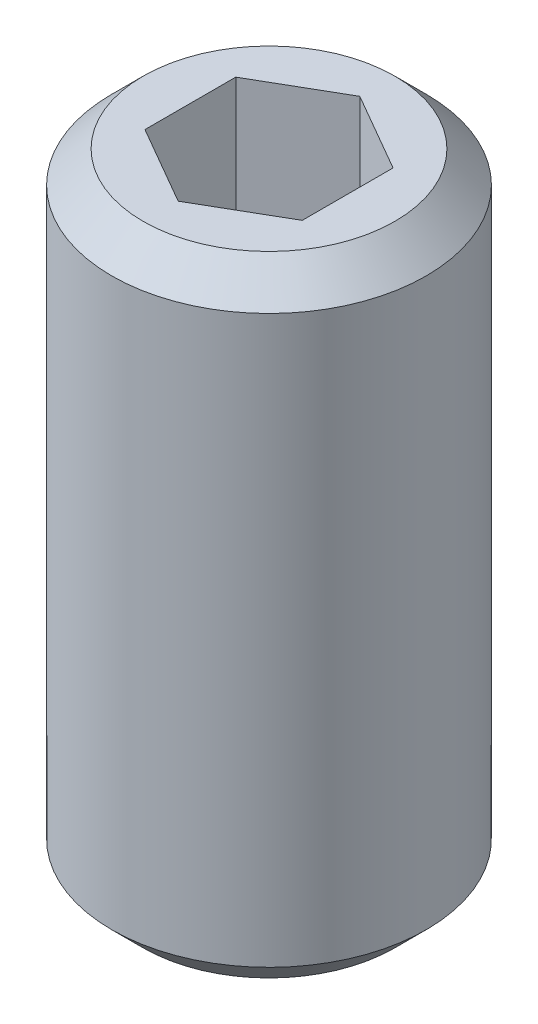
ISO-10303-21;
HEADER;
FILE_DESCRIPTION(('STEP AP214'),'2;1');
FILE_NAME('part.step','',(''),(''),'','','');
FILE_SCHEMA(('AUTOMOTIVE_DESIGN { 1 0 10303 214 1 1 1 1 }'));
ENDSEC;
DATA;
#1=APPLICATION_CONTEXT('core data for automotive mechanical design processes');
#2=APPLICATION_PROTOCOL_DEFINITION('international standard','automotive_design',2000,#1);
#3=PRODUCT_CONTEXT('',#1,'mechanical');
#4=PRODUCT('Part','Part','',(#3));
#5=PRODUCT_RELATED_PRODUCT_CATEGORY('part','',(#4));
#6=PRODUCT_DEFINITION_FORMATION('','',#4);
#7=PRODUCT_DEFINITION_CONTEXT('part definition',#1,'design');
#8=PRODUCT_DEFINITION('design','',#6,#7);
#9=PRODUCT_DEFINITION_SHAPE('','',#8);
#10=(LENGTH_UNIT() NAMED_UNIT(*) SI_UNIT(.MILLI.,.METRE.));
#11=(NAMED_UNIT(*) PLANE_ANGLE_UNIT() SI_UNIT($,.RADIAN.));
#12=(NAMED_UNIT(*) SI_UNIT($,.STERADIAN.) SOLID_ANGLE_UNIT());
#13=UNCERTAINTY_MEASURE_WITH_UNIT(LENGTH_MEASURE(1.E-05),#10,'distance_accuracy_value','');
#14=(GEOMETRIC_REPRESENTATION_CONTEXT(3) GLOBAL_UNCERTAINTY_ASSIGNED_CONTEXT((#13)) GLOBAL_UNIT_ASSIGNED_CONTEXT((#10,
#11,#12)) REPRESENTATION_CONTEXT('',''));
#15=CARTESIAN_POINT('',(0.,0.,0.));
#16=DIRECTION('',(0.,0.,1.));
#17=DIRECTION('',(1.,0.,0.));
#18=AXIS2_PLACEMENT_3D('',#15,#16,#17);
#19=CARTESIAN_POINT('',(0.,-10.,0.));
#20=DIRECTION('',(0.,1.,0.));
#21=DIRECTION('',(0.,0.,1.));
#22=AXIS2_PLACEMENT_3D('',#19,#20,#21);
#23=PLANE('',#22);
#24=CARTESIAN_POINT('',(0.,-10.,0.));
#25=DIRECTION('',(0.,1.,0.));
#26=DIRECTION('',(0.,0.,1.));
#27=AXIS2_PLACEMENT_3D('',#24,#25,#26);
#28=CIRCLE('',#27,2.);
#29=CARTESIAN_POINT('',(0.,-10.,2.));
#30=VERTEX_POINT('',#29);
#31=EDGE_CURVE('E148',#30,#30,#28,.F.);
#32=ORIENTED_EDGE('',*,*,#31,.T.);
#33=EDGE_LOOP('',(#32));
#34=FACE_BOUND('',#33,.T.);
#35=ADVANCED_FACE('F37',(#34),#23,.F.);
#36=CARTESIAN_POINT('',(0.,0.,0.));
#37=DIRECTION('',(0.,1.,0.));
#38=DIRECTION('',(0.,0.,1.));
#39=AXIS2_PLACEMENT_3D('',#36,#37,#38);
#40=CYLINDRICAL_SURFACE('',#39,2.5);
#41=CARTESIAN_POINT('',(0.,-0.5,0.));
#42=DIRECTION('',(0.,-1.,0.));
#43=DIRECTION('',(0.,0.,-1.));
#44=AXIS2_PLACEMENT_3D('',#41,#42,#43);
#45=CIRCLE('',#44,2.5);
#46=CARTESIAN_POINT('',(0.,-0.5,-2.5));
#47=VERTEX_POINT('',#46);
#48=EDGE_CURVE('E11',#47,#47,#45,.T.);
#49=ORIENTED_EDGE('',*,*,#48,.T.);
#50=EDGE_LOOP('',(#49));
#51=FACE_BOUND('',#50,.T.);
#52=CARTESIAN_POINT('',(0.,-9.5,0.));
#53=DIRECTION('',(0.,1.,0.));
#54=DIRECTION('',(0.,0.,1.));
#55=AXIS2_PLACEMENT_3D('',#52,#53,#54);
#56=CIRCLE('',#55,2.5);
#57=CARTESIAN_POINT('',(0.,-9.5,2.5));
#58=VERTEX_POINT('',#57);
#59=EDGE_CURVE('E139',#58,#58,#56,.T.);
#60=ORIENTED_EDGE('',*,*,#59,.T.);
#61=EDGE_LOOP('',(#60));
#62=FACE_BOUND('',#61,.T.);
#63=ADVANCED_FACE('F169',(#51,#62),#40,.T.);
#64=CARTESIAN_POINT('',(0.,0.,0.));
#65=DIRECTION('',(0.,-1.,0.));
#66=DIRECTION('',(0.,0.,-1.));
#67=AXIS2_PLACEMENT_3D('',#64,#65,#66);
#68=PLANE('',#67);
#69=DIRECTION('',(0.866025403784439,0.,-0.5));
#70=VECTOR('',#69,1.);
#71=CARTESIAN_POINT('',(0.,0.,1.44337567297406));
#72=LINE('',#71,#70);
#73=CARTESIAN_POINT('',(0.,0.,1.44337567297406));
#74=VERTEX_POINT('',#73);
#75=CARTESIAN_POINT('',(1.24999999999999,0.,0.721687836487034));
#76=VERTEX_POINT('',#75);
#77=EDGE_CURVE('E105',#74,#76,#72,.T.);
#78=ORIENTED_EDGE('',*,*,#77,.F.);
#79=DIRECTION('',(0.866025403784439,0.,0.5));
#80=VECTOR('',#79,1.);
#81=CARTESIAN_POINT('',(-1.25000000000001,0.,0.721687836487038));
#82=LINE('',#81,#80);
#83=CARTESIAN_POINT('',(-1.25000000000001,0.,0.721687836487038));
#84=VERTEX_POINT('',#83);
#85=EDGE_CURVE('E51',#84,#74,#82,.T.);
#86=ORIENTED_EDGE('',*,*,#85,.F.);
#87=DIRECTION('',(0.,0.,1.));
#88=VECTOR('',#87,1.);
#89=CARTESIAN_POINT('',(-1.25,0.,-0.721687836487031));
#90=LINE('',#89,#88);
#91=CARTESIAN_POINT('',(-1.25,0.,-0.721687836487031));
#92=VERTEX_POINT('',#91);
#93=EDGE_CURVE('E121',#92,#84,#90,.T.);
#94=ORIENTED_EDGE('',*,*,#93,.F.);
#95=DIRECTION('',(-0.866025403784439,0.,0.5));
#96=VECTOR('',#95,1.);
#97=CARTESIAN_POINT('',(0.,0.,-1.44337567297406));
#98=LINE('',#97,#96);
#99=CARTESIAN_POINT('',(0.,0.,-1.44337567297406));
#100=VERTEX_POINT('',#99);
#101=EDGE_CURVE('E115',#100,#92,#98,.T.);
#102=ORIENTED_EDGE('',*,*,#101,.F.);
#103=DIRECTION('',(-0.866025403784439,0.,-0.5));
#104=VECTOR('',#103,1.);
#105=CARTESIAN_POINT('',(1.24999999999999,0.,-0.721687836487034));
#106=LINE('',#105,#104);
#107=CARTESIAN_POINT('',(1.24999999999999,0.,-0.721687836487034));
#108=VERTEX_POINT('',#107);
#109=EDGE_CURVE('E113',#108,#100,#106,.T.);
#110=ORIENTED_EDGE('',*,*,#109,.F.);
#111=DIRECTION('',(0.,0.,-1.));
#112=VECTOR('',#111,1.);
#113=CARTESIAN_POINT('',(1.24999999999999,0.,0.721687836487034));
#114=LINE('',#113,#112);
#115=EDGE_CURVE('E94',#76,#108,#114,.T.);
#116=ORIENTED_EDGE('',*,*,#115,.F.);
#117=EDGE_LOOP('',(#78,#86,#94,#102,#110,#116));
#118=FACE_BOUND('',#117,.T.);
#119=CARTESIAN_POINT('',(0.,0.,0.));
#120=DIRECTION('',(0.,-1.,0.));
#121=DIRECTION('',(0.,0.,-1.));
#122=AXIS2_PLACEMENT_3D('',#119,#120,#121);
#123=CIRCLE('',#122,2.);
#124=CARTESIAN_POINT('',(0.,0.,-2.));
#125=VERTEX_POINT('',#124);
#126=EDGE_CURVE('E44',#125,#125,#123,.F.);
#127=ORIENTED_EDGE('',*,*,#126,.T.);
#128=EDGE_LOOP('',(#127));
#129=FACE_BOUND('',#128,.T.);
#130=ADVANCED_FACE('F109',(#118,#129),#68,.F.);
#131=CARTESIAN_POINT('',(0.,-9.5,0.));
#132=DIRECTION('',(0.,1.,0.));
#133=DIRECTION('',(0.,0.,1.));
#134=AXIS2_PLACEMENT_3D('',#131,#132,#133);
#135=CONICAL_SURFACE('',#134,2.5,0.78539816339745);
#136=ORIENTED_EDGE('',*,*,#31,.F.);
#137=EDGE_LOOP('',(#136));
#138=FACE_BOUND('',#137,.T.);
#139=ORIENTED_EDGE('',*,*,#59,.F.);
#140=EDGE_LOOP('',(#139));
#141=FACE_BOUND('',#140,.T.);
#142=ADVANCED_FACE('F156',(#138,#141),#135,.T.);
#143=CARTESIAN_POINT('',(0.,0.,0.));
#144=DIRECTION('',(0.,-1.,0.));
#145=DIRECTION('',(0.,0.,-1.));
#146=AXIS2_PLACEMENT_3D('',#143,#144,#145);
#147=CONICAL_SURFACE('',#146,2.,0.785398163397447);
#148=ORIENTED_EDGE('',*,*,#48,.F.);
#149=EDGE_LOOP('',(#148));
#150=FACE_BOUND('',#149,.T.);
#151=ORIENTED_EDGE('',*,*,#126,.F.);
#152=EDGE_LOOP('',(#151));
#153=FACE_BOUND('',#152,.T.);
#154=ADVANCED_FACE('F153',(#150,#153),#147,.T.);
#155=CARTESIAN_POINT('',(-1.25000000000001,-3.5,0.721687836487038));
#156=DIRECTION('',(-0.5,0.,0.866025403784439));
#157=DIRECTION('',(0.866025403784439,0.,0.5));
#158=AXIS2_PLACEMENT_3D('',#155,#156,#157);
#159=PLANE('',#158);
#160=ORIENTED_EDGE('',*,*,#85,.T.);
#161=DIRECTION('',(0.,1.,0.));
#162=VECTOR('',#161,1.);
#163=CARTESIAN_POINT('',(0.,-3.5,1.44337567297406));
#164=LINE('',#163,#162);
#165=CARTESIAN_POINT('',(0.,-3.5,1.44337567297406));
#166=VERTEX_POINT('',#165);
#167=EDGE_CURVE('E102',#166,#74,#164,.T.);
#168=ORIENTED_EDGE('',*,*,#167,.F.);
#169=DIRECTION('',(0.866025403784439,0.,0.5));
#170=VECTOR('',#169,1.);
#171=CARTESIAN_POINT('',(-1.25000000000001,-3.5,0.721687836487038));
#172=LINE('',#171,#170);
#173=CARTESIAN_POINT('',(-1.25000000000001,-3.5,0.721687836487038));
#174=VERTEX_POINT('',#173);
#175=EDGE_CURVE('E123',#174,#166,#172,.T.);
#176=ORIENTED_EDGE('',*,*,#175,.F.);
#177=DIRECTION('',(0.,1.,0.));
#178=VECTOR('',#177,1.);
#179=CARTESIAN_POINT('',(-1.25000000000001,-3.5,0.721687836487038));
#180=LINE('',#179,#178);
#181=EDGE_CURVE('E58',#174,#84,#180,.T.);
#182=ORIENTED_EDGE('',*,*,#181,.T.);
#183=EDGE_LOOP('',(#160,#168,#176,#182));
#184=FACE_BOUND('',#183,.T.);
#185=ADVANCED_FACE('F155',(#184),#159,.F.);
#186=CARTESIAN_POINT('',(-1.25,-3.5,-0.721687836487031));
#187=DIRECTION('',(-1.,0.,0.));
#188=DIRECTION('',(0.,0.,1.));
#189=AXIS2_PLACEMENT_3D('',#186,#187,#188);
#190=PLANE('',#189);
#191=ORIENTED_EDGE('',*,*,#93,.T.);
#192=ORIENTED_EDGE('',*,*,#181,.F.);
#193=DIRECTION('',(0.,0.,1.));
#194=VECTOR('',#193,1.);
#195=CARTESIAN_POINT('',(-1.25,-3.5,-0.721687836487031));
#196=LINE('',#195,#194);
#197=CARTESIAN_POINT('',(-1.25,-3.5,-0.721687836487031));
#198=VERTEX_POINT('',#197);
#199=EDGE_CURVE('E135',#198,#174,#196,.T.);
#200=ORIENTED_EDGE('',*,*,#199,.F.);
#201=DIRECTION('',(0.,1.,0.));
#202=VECTOR('',#201,1.);
#203=CARTESIAN_POINT('',(-1.25,-3.5,-0.721687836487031));
#204=LINE('',#203,#202);
#205=EDGE_CURVE('E140',#198,#92,#204,.T.);
#206=ORIENTED_EDGE('',*,*,#205,.T.);
#207=EDGE_LOOP('',(#191,#192,#200,#206));
#208=FACE_BOUND('',#207,.T.);
#209=ADVANCED_FACE('F163',(#208),#190,.F.);
#210=CARTESIAN_POINT('',(0.,-3.5,-1.44337567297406));
#211=DIRECTION('',(-0.5,0.,-0.866025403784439));
#212=DIRECTION('',(-0.866025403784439,0.,0.5));
#213=AXIS2_PLACEMENT_3D('',#210,#211,#212);
#214=PLANE('',#213);
#215=ORIENTED_EDGE('',*,*,#101,.T.);
#216=ORIENTED_EDGE('',*,*,#205,.F.);
#217=DIRECTION('',(-0.866025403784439,0.,0.5));
#218=VECTOR('',#217,1.);
#219=CARTESIAN_POINT('',(0.,-3.5,-1.44337567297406));
#220=LINE('',#219,#218);
#221=CARTESIAN_POINT('',(0.,-3.5,-1.44337567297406));
#222=VERTEX_POINT('',#221);
#223=EDGE_CURVE('E132',#222,#198,#220,.T.);
#224=ORIENTED_EDGE('',*,*,#223,.F.);
#225=DIRECTION('',(0.,1.,0.));
#226=VECTOR('',#225,1.);
#227=CARTESIAN_POINT('',(0.,-3.5,-1.44337567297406));
#228=LINE('',#227,#226);
#229=EDGE_CURVE('E142',#222,#100,#228,.T.);
#230=ORIENTED_EDGE('',*,*,#229,.T.);
#231=EDGE_LOOP('',(#215,#216,#224,#230));
#232=FACE_BOUND('',#231,.T.);
#233=ADVANCED_FACE('F208',(#232),#214,.F.);
#234=CARTESIAN_POINT('',(1.24999999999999,-3.5,-0.721687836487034));
#235=DIRECTION('',(0.5,0.,-0.866025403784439));
#236=DIRECTION('',(-0.866025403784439,0.,-0.5));
#237=AXIS2_PLACEMENT_3D('',#234,#235,#236);
#238=PLANE('',#237);
#239=ORIENTED_EDGE('',*,*,#109,.T.);
#240=ORIENTED_EDGE('',*,*,#229,.F.);
#241=DIRECTION('',(-0.866025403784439,0.,-0.5));
#242=VECTOR('',#241,1.);
#243=CARTESIAN_POINT('',(1.24999999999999,-3.5,-0.721687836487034));
#244=LINE('',#243,#242);
#245=CARTESIAN_POINT('',(1.24999999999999,-3.5,-0.721687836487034));
#246=VERTEX_POINT('',#245);
#247=EDGE_CURVE('E129',#246,#222,#244,.T.);
#248=ORIENTED_EDGE('',*,*,#247,.F.);
#249=DIRECTION('',(0.,1.,0.));
#250=VECTOR('',#249,1.);
#251=CARTESIAN_POINT('',(1.24999999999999,-3.5,-0.721687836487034));
#252=LINE('',#251,#250);
#253=EDGE_CURVE('E101',#246,#108,#252,.T.);
#254=ORIENTED_EDGE('',*,*,#253,.T.);
#255=EDGE_LOOP('',(#239,#240,#248,#254));
#256=FACE_BOUND('',#255,.T.);
#257=ADVANCED_FACE('F217',(#256),#238,.F.);
#258=CARTESIAN_POINT('',(1.24999999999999,-3.5,0.721687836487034));
#259=DIRECTION('',(1.,0.,0.));
#260=DIRECTION('',(0.,0.,-1.));
#261=AXIS2_PLACEMENT_3D('',#258,#259,#260);
#262=PLANE('',#261);
#263=ORIENTED_EDGE('',*,*,#115,.T.);
#264=ORIENTED_EDGE('',*,*,#253,.F.);
#265=DIRECTION('',(0.,0.,-1.));
#266=VECTOR('',#265,1.);
#267=CARTESIAN_POINT('',(1.24999999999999,-3.5,0.721687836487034));
#268=LINE('',#267,#266);
#269=CARTESIAN_POINT('',(1.24999999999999,-3.5,0.721687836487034));
#270=VERTEX_POINT('',#269);
#271=EDGE_CURVE('E97',#270,#246,#268,.T.);
#272=ORIENTED_EDGE('',*,*,#271,.F.);
#273=DIRECTION('',(0.,1.,0.));
#274=VECTOR('',#273,1.);
#275=CARTESIAN_POINT('',(1.24999999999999,-3.5,0.721687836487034));
#276=LINE('',#275,#274);
#277=EDGE_CURVE('E90',#270,#76,#276,.T.);
#278=ORIENTED_EDGE('',*,*,#277,.T.);
#279=EDGE_LOOP('',(#263,#264,#272,#278));
#280=FACE_BOUND('',#279,.T.);
#281=ADVANCED_FACE('F92',(#280),#262,.F.);
#282=CARTESIAN_POINT('',(0.,-3.5,1.44337567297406));
#283=DIRECTION('',(0.500000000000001,0.,0.866025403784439));
#284=DIRECTION('',(0.866025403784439,0.,-0.5));
#285=AXIS2_PLACEMENT_3D('',#282,#283,#284);
#286=PLANE('',#285);
#287=ORIENTED_EDGE('',*,*,#77,.T.);
#288=ORIENTED_EDGE('',*,*,#277,.F.);
#289=DIRECTION('',(0.866025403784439,0.,-0.5));
#290=VECTOR('',#289,1.);
#291=CARTESIAN_POINT('',(0.,-3.5,1.44337567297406));
#292=LINE('',#291,#290);
#293=EDGE_CURVE('E126',#166,#270,#292,.T.);
#294=ORIENTED_EDGE('',*,*,#293,.F.);
#295=ORIENTED_EDGE('',*,*,#167,.T.);
#296=EDGE_LOOP('',(#287,#288,#294,#295));
#297=FACE_BOUND('',#296,.T.);
#298=ADVANCED_FACE('F106',(#297),#286,.F.);
#299=CARTESIAN_POINT('',(-1.25000000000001,-3.5,0.721687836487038));
#300=DIRECTION('',(0.,-1.,0.));
#301=DIRECTION('',(0.,0.,-1.));
#302=AXIS2_PLACEMENT_3D('',#299,#300,#301);
#303=PLANE('',#302);
#304=ORIENTED_EDGE('',*,*,#175,.T.);
#305=ORIENTED_EDGE('',*,*,#293,.T.);
#306=ORIENTED_EDGE('',*,*,#271,.T.);
#307=ORIENTED_EDGE('',*,*,#247,.T.);
#308=ORIENTED_EDGE('',*,*,#223,.T.);
#309=ORIENTED_EDGE('',*,*,#199,.T.);
#310=EDGE_LOOP('',(#304,#305,#306,#307,#308,#309));
#311=FACE_BOUND('',#310,.T.);
#312=ADVANCED_FACE('F244',(#311),#303,.F.);
#313=CLOSED_SHELL('',(#35,#63,#130,#142,#154,#185,#209,#233,#257,#281,#298,#312));
#314=MANIFOLD_SOLID_BREP('B2',#313);
#315=ADVANCED_BREP_SHAPE_REPRESENTATION('',(#18,#314),#14);
#316=SHAPE_DEFINITION_REPRESENTATION(#9,#315);
ENDSEC;
END-ISO-10303-21;
